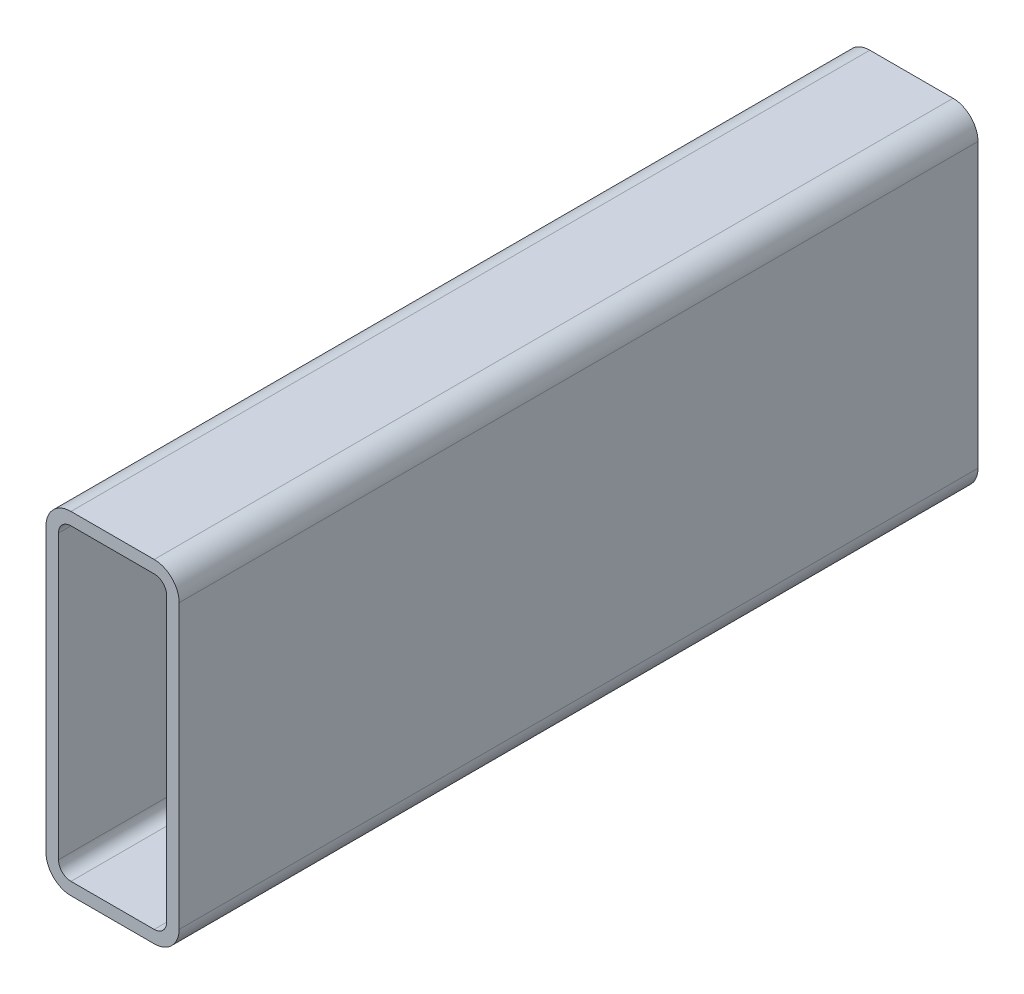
ISO-10303-21;
HEADER;
FILE_DESCRIPTION(('STEP AP214'),'2;1');
FILE_NAME('part.step','',(''),(''),'','','');
FILE_SCHEMA(('AUTOMOTIVE_DESIGN { 1 0 10303 214 1 1 1 1 }'));
ENDSEC;
DATA;
#1=APPLICATION_CONTEXT('core data for automotive mechanical design processes');
#2=APPLICATION_PROTOCOL_DEFINITION('international standard','automotive_design',2000,#1);
#3=PRODUCT_CONTEXT('',#1,'mechanical');
#4=PRODUCT('Part','Part','',(#3));
#5=PRODUCT_RELATED_PRODUCT_CATEGORY('part','',(#4));
#6=PRODUCT_DEFINITION_FORMATION('','',#4);
#7=PRODUCT_DEFINITION_CONTEXT('part definition',#1,'design');
#8=PRODUCT_DEFINITION('design','',#6,#7);
#9=PRODUCT_DEFINITION_SHAPE('','',#8);
#10=(LENGTH_UNIT() NAMED_UNIT(*) SI_UNIT(.MILLI.,.METRE.));
#11=(NAMED_UNIT(*) PLANE_ANGLE_UNIT() SI_UNIT($,.RADIAN.));
#12=(NAMED_UNIT(*) SI_UNIT($,.STERADIAN.) SOLID_ANGLE_UNIT());
#13=UNCERTAINTY_MEASURE_WITH_UNIT(LENGTH_MEASURE(1.E-05),#10,'distance_accuracy_value','');
#14=(GEOMETRIC_REPRESENTATION_CONTEXT(3) GLOBAL_UNCERTAINTY_ASSIGNED_CONTEXT((#13)) GLOBAL_UNIT_ASSIGNED_CONTEXT((#10,
#11,#12)) REPRESENTATION_CONTEXT('',''));
#15=CARTESIAN_POINT('',(0.,0.,0.));
#16=DIRECTION('',(0.,0.,1.));
#17=DIRECTION('',(1.,0.,0.));
#18=AXIS2_PLACEMENT_3D('',#15,#16,#17);
#19=CARTESIAN_POINT('',(9.52500000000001,117.475,304.8));
#20=DIRECTION('',(0.,0.,1.));
#21=DIRECTION('',(1.,0.,0.));
#22=AXIS2_PLACEMENT_3D('',#19,#20,#21);
#23=PLANE('',#22);
#24=CARTESIAN_POINT('',(9.52500000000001,117.475,304.8));
#25=DIRECTION('',(0.,0.,1.));
#26=DIRECTION('',(1.,0.,0.));
#27=AXIS2_PLACEMENT_3D('',#24,#25,#26);
#28=CIRCLE('',#27,9.52500000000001);
#29=CARTESIAN_POINT('',(9.525,127.,304.8));
#30=VERTEX_POINT('',#29);
#31=CARTESIAN_POINT('',(0.,117.475,304.8));
#32=VERTEX_POINT('',#31);
#33=EDGE_CURVE('E211',#30,#32,#28,.T.);
#34=ORIENTED_EDGE('',*,*,#33,.T.);
#35=DIRECTION('',(0.,-1.,0.));
#36=VECTOR('',#35,1.);
#37=CARTESIAN_POINT('',(0.,9.525,304.8));
#38=LINE('',#37,#36);
#39=CARTESIAN_POINT('',(0.,9.525,304.8));
#40=VERTEX_POINT('',#39);
#41=EDGE_CURVE('E214',#32,#40,#38,.T.);
#42=ORIENTED_EDGE('',*,*,#41,.T.);
#43=CARTESIAN_POINT('',(9.525,9.525,304.8));
#44=DIRECTION('',(0.,0.,1.));
#45=DIRECTION('',(1.,0.,0.));
#46=AXIS2_PLACEMENT_3D('',#43,#44,#45);
#47=CIRCLE('',#46,9.525);
#48=CARTESIAN_POINT('',(9.525,0.,304.8));
#49=VERTEX_POINT('',#48);
#50=EDGE_CURVE('E217',#40,#49,#47,.T.);
#51=ORIENTED_EDGE('',*,*,#50,.T.);
#52=DIRECTION('',(1.,0.,0.));
#53=VECTOR('',#52,1.);
#54=CARTESIAN_POINT('',(41.275,0.,304.8));
#55=LINE('',#54,#53);
#56=CARTESIAN_POINT('',(41.275,0.,304.8));
#57=VERTEX_POINT('',#56);
#58=EDGE_CURVE('E219',#49,#57,#55,.T.);
#59=ORIENTED_EDGE('',*,*,#58,.T.);
#60=CARTESIAN_POINT('',(41.275,9.525,304.8));
#61=DIRECTION('',(0.,0.,1.));
#62=DIRECTION('',(1.,0.,0.));
#63=AXIS2_PLACEMENT_3D('',#60,#61,#62);
#64=CIRCLE('',#63,9.525);
#65=CARTESIAN_POINT('',(50.8,9.525,304.8));
#66=VERTEX_POINT('',#65);
#67=EDGE_CURVE('E221',#57,#66,#64,.T.);
#68=ORIENTED_EDGE('',*,*,#67,.T.);
#69=DIRECTION('',(0.,1.,0.));
#70=VECTOR('',#69,1.);
#71=CARTESIAN_POINT('',(50.8,117.475,304.8));
#72=LINE('',#71,#70);
#73=CARTESIAN_POINT('',(50.8,117.475,304.8));
#74=VERTEX_POINT('',#73);
#75=EDGE_CURVE('E223',#66,#74,#72,.T.);
#76=ORIENTED_EDGE('',*,*,#75,.T.);
#77=CARTESIAN_POINT('',(41.275,117.475,304.8));
#78=DIRECTION('',(0.,0.,1.));
#79=DIRECTION('',(1.,0.,0.));
#80=AXIS2_PLACEMENT_3D('',#77,#78,#79);
#81=CIRCLE('',#80,9.52500000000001);
#82=CARTESIAN_POINT('',(41.275,127.,304.8));
#83=VERTEX_POINT('',#82);
#84=EDGE_CURVE('E225',#74,#83,#81,.T.);
#85=ORIENTED_EDGE('',*,*,#84,.T.);
#86=DIRECTION('',(-1.,0.,0.));
#87=VECTOR('',#86,1.);
#88=CARTESIAN_POINT('',(9.525,127.,304.8));
#89=LINE('',#88,#87);
#90=EDGE_CURVE('E227',#83,#30,#89,.T.);
#91=ORIENTED_EDGE('',*,*,#90,.T.);
#92=EDGE_LOOP('',(#34,#42,#51,#59,#68,#76,#85,#91));
#93=FACE_BOUND('',#92,.T.);
#94=DIRECTION('',(0.,-1.,0.));
#95=VECTOR('',#94,1.);
#96=CARTESIAN_POINT('',(4.7625,9.525,304.8));
#97=LINE('',#96,#95);
#98=CARTESIAN_POINT('',(4.7625,117.475,304.8));
#99=VERTEX_POINT('',#98);
#100=CARTESIAN_POINT('',(4.7625,9.525,304.8));
#101=VERTEX_POINT('',#100);
#102=EDGE_CURVE('E154',#99,#101,#97,.T.);
#103=ORIENTED_EDGE('',*,*,#102,.F.);
#104=CARTESIAN_POINT('',(9.52500000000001,117.475,304.8));
#105=DIRECTION('',(0.,0.,1.));
#106=DIRECTION('',(1.,0.,0.));
#107=AXIS2_PLACEMENT_3D('',#104,#105,#106);
#108=CIRCLE('',#107,4.7625);
#109=CARTESIAN_POINT('',(9.525,122.2375,304.8));
#110=VERTEX_POINT('',#109);
#111=EDGE_CURVE('E146',#110,#99,#108,.T.);
#112=ORIENTED_EDGE('',*,*,#111,.F.);
#113=DIRECTION('',(-1.,0.,0.));
#114=VECTOR('',#113,1.);
#115=CARTESIAN_POINT('',(9.525,122.2375,304.8));
#116=LINE('',#115,#114);
#117=CARTESIAN_POINT('',(41.275,122.2375,304.8));
#118=VERTEX_POINT('',#117);
#119=EDGE_CURVE('E179',#118,#110,#116,.T.);
#120=ORIENTED_EDGE('',*,*,#119,.F.);
#121=CARTESIAN_POINT('',(41.275,117.475,304.8));
#122=DIRECTION('',(0.,0.,1.));
#123=DIRECTION('',(1.,0.,0.));
#124=AXIS2_PLACEMENT_3D('',#121,#122,#123);
#125=CIRCLE('',#124,4.7625);
#126=CARTESIAN_POINT('',(46.0375,117.475,304.8));
#127=VERTEX_POINT('',#126);
#128=EDGE_CURVE('E177',#127,#118,#125,.T.);
#129=ORIENTED_EDGE('',*,*,#128,.F.);
#130=DIRECTION('',(0.,1.,0.));
#131=VECTOR('',#130,1.);
#132=CARTESIAN_POINT('',(46.0375,117.475,304.8));
#133=LINE('',#132,#131);
#134=CARTESIAN_POINT('',(46.0375,9.525,304.8));
#135=VERTEX_POINT('',#134);
#136=EDGE_CURVE('E175',#135,#127,#133,.T.);
#137=ORIENTED_EDGE('',*,*,#136,.F.);
#138=CARTESIAN_POINT('',(41.275,9.525,304.8));
#139=DIRECTION('',(0.,0.,1.));
#140=DIRECTION('',(1.,0.,0.));
#141=AXIS2_PLACEMENT_3D('',#138,#139,#140);
#142=CIRCLE('',#141,4.7625);
#143=CARTESIAN_POINT('',(41.275,4.7625,304.8));
#144=VERTEX_POINT('',#143);
#145=EDGE_CURVE('E173',#144,#135,#142,.T.);
#146=ORIENTED_EDGE('',*,*,#145,.F.);
#147=DIRECTION('',(1.,0.,0.));
#148=VECTOR('',#147,1.);
#149=CARTESIAN_POINT('',(41.275,4.7625,304.8));
#150=LINE('',#149,#148);
#151=CARTESIAN_POINT('',(9.525,4.7625,304.8));
#152=VERTEX_POINT('',#151);
#153=EDGE_CURVE('E169',#152,#144,#150,.T.);
#154=ORIENTED_EDGE('',*,*,#153,.F.);
#155=CARTESIAN_POINT('',(9.525,9.525,304.8));
#156=DIRECTION('',(0.,0.,1.));
#157=DIRECTION('',(1.,0.,0.));
#158=AXIS2_PLACEMENT_3D('',#155,#156,#157);
#159=CIRCLE('',#158,4.7625);
#160=EDGE_CURVE('E167',#101,#152,#159,.T.);
#161=ORIENTED_EDGE('',*,*,#160,.F.);
#162=EDGE_LOOP('',(#103,#112,#120,#129,#137,#146,#154,#161));
#163=FACE_BOUND('',#162,.T.);
#164=ADVANCED_FACE('F33',(#93,#163),#23,.T.);
#165=CARTESIAN_POINT('',(9.52500000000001,117.475,0.));
#166=DIRECTION('',(0.,0.,1.));
#167=DIRECTION('',(1.,0.,0.));
#168=AXIS2_PLACEMENT_3D('',#165,#166,#167);
#169=PLANE('',#168);
#170=CARTESIAN_POINT('',(9.52500000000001,117.475,0.));
#171=DIRECTION('',(0.,0.,1.));
#172=DIRECTION('',(1.,0.,0.));
#173=AXIS2_PLACEMENT_3D('',#170,#171,#172);
#174=CIRCLE('',#173,9.52500000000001);
#175=CARTESIAN_POINT('',(9.525,127.,0.));
#176=VERTEX_POINT('',#175);
#177=CARTESIAN_POINT('',(0.,117.475,0.));
#178=VERTEX_POINT('',#177);
#179=EDGE_CURVE('E162',#176,#178,#174,.T.);
#180=ORIENTED_EDGE('',*,*,#179,.F.);
#181=DIRECTION('',(-1.,0.,0.));
#182=VECTOR('',#181,1.);
#183=CARTESIAN_POINT('',(9.525,127.,0.));
#184=LINE('',#183,#182);
#185=CARTESIAN_POINT('',(41.275,127.,0.));
#186=VERTEX_POINT('',#185);
#187=EDGE_CURVE('E215',#186,#176,#184,.T.);
#188=ORIENTED_EDGE('',*,*,#187,.F.);
#189=CARTESIAN_POINT('',(41.275,117.475,0.));
#190=DIRECTION('',(0.,0.,1.));
#191=DIRECTION('',(1.,0.,0.));
#192=AXIS2_PLACEMENT_3D('',#189,#190,#191);
#193=CIRCLE('',#192,9.52500000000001);
#194=CARTESIAN_POINT('',(50.8,117.475,0.));
#195=VERTEX_POINT('',#194);
#196=EDGE_CURVE('E242',#195,#186,#193,.T.);
#197=ORIENTED_EDGE('',*,*,#196,.F.);
#198=DIRECTION('',(0.,1.,0.));
#199=VECTOR('',#198,1.);
#200=CARTESIAN_POINT('',(50.8,117.475,0.));
#201=LINE('',#200,#199);
#202=CARTESIAN_POINT('',(50.8,9.525,0.));
#203=VERTEX_POINT('',#202);
#204=EDGE_CURVE('E240',#203,#195,#201,.T.);
#205=ORIENTED_EDGE('',*,*,#204,.F.);
#206=CARTESIAN_POINT('',(41.275,9.525,0.));
#207=DIRECTION('',(0.,0.,1.));
#208=DIRECTION('',(1.,0.,0.));
#209=AXIS2_PLACEMENT_3D('',#206,#207,#208);
#210=CIRCLE('',#209,9.525);
#211=CARTESIAN_POINT('',(41.275,0.,0.));
#212=VERTEX_POINT('',#211);
#213=EDGE_CURVE('E238',#212,#203,#210,.T.);
#214=ORIENTED_EDGE('',*,*,#213,.F.);
#215=DIRECTION('',(1.,0.,0.));
#216=VECTOR('',#215,1.);
#217=CARTESIAN_POINT('',(41.275,0.,0.));
#218=LINE('',#217,#216);
#219=CARTESIAN_POINT('',(9.525,0.,0.));
#220=VERTEX_POINT('',#219);
#221=EDGE_CURVE('E236',#220,#212,#218,.T.);
#222=ORIENTED_EDGE('',*,*,#221,.F.);
#223=CARTESIAN_POINT('',(9.525,9.525,0.));
#224=DIRECTION('',(0.,0.,1.));
#225=DIRECTION('',(1.,0.,0.));
#226=AXIS2_PLACEMENT_3D('',#223,#224,#225);
#227=CIRCLE('',#226,9.525);
#228=CARTESIAN_POINT('',(0.,9.525,0.));
#229=VERTEX_POINT('',#228);
#230=EDGE_CURVE('E234',#229,#220,#227,.T.);
#231=ORIENTED_EDGE('',*,*,#230,.F.);
#232=DIRECTION('',(0.,-1.,0.));
#233=VECTOR('',#232,1.);
#234=CARTESIAN_POINT('',(0.,9.525,0.));
#235=LINE('',#234,#233);
#236=EDGE_CURVE('E232',#178,#229,#235,.T.);
#237=ORIENTED_EDGE('',*,*,#236,.F.);
#238=EDGE_LOOP('',(#180,#188,#197,#205,#214,#222,#231,#237));
#239=FACE_BOUND('',#238,.T.);
#240=CARTESIAN_POINT('',(9.52500000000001,117.475,0.));
#241=DIRECTION('',(0.,0.,1.));
#242=DIRECTION('',(1.,0.,0.));
#243=AXIS2_PLACEMENT_3D('',#240,#241,#242);
#244=CIRCLE('',#243,4.7625);
#245=CARTESIAN_POINT('',(9.525,122.2375,0.));
#246=VERTEX_POINT('',#245);
#247=CARTESIAN_POINT('',(4.7625,117.475,0.));
#248=VERTEX_POINT('',#247);
#249=EDGE_CURVE('E56',#246,#248,#244,.T.);
#250=ORIENTED_EDGE('',*,*,#249,.T.);
#251=DIRECTION('',(0.,-1.,0.));
#252=VECTOR('',#251,1.);
#253=CARTESIAN_POINT('',(4.7625,9.525,0.));
#254=LINE('',#253,#252);
#255=CARTESIAN_POINT('',(4.7625,9.525,0.));
#256=VERTEX_POINT('',#255);
#257=EDGE_CURVE('E161',#248,#256,#254,.T.);
#258=ORIENTED_EDGE('',*,*,#257,.T.);
#259=CARTESIAN_POINT('',(9.525,9.525,0.));
#260=DIRECTION('',(0.,0.,1.));
#261=DIRECTION('',(1.,0.,0.));
#262=AXIS2_PLACEMENT_3D('',#259,#260,#261);
#263=CIRCLE('',#262,4.7625);
#264=CARTESIAN_POINT('',(9.525,4.7625,0.));
#265=VERTEX_POINT('',#264);
#266=EDGE_CURVE('E183',#256,#265,#263,.T.);
#267=ORIENTED_EDGE('',*,*,#266,.T.);
#268=DIRECTION('',(1.,0.,0.));
#269=VECTOR('',#268,1.);
#270=CARTESIAN_POINT('',(41.275,4.7625,0.));
#271=LINE('',#270,#269);
#272=CARTESIAN_POINT('',(41.275,4.7625,0.));
#273=VERTEX_POINT('',#272);
#274=EDGE_CURVE('E186',#265,#273,#271,.T.);
#275=ORIENTED_EDGE('',*,*,#274,.T.);
#276=CARTESIAN_POINT('',(41.275,9.525,0.));
#277=DIRECTION('',(0.,0.,1.));
#278=DIRECTION('',(1.,0.,0.));
#279=AXIS2_PLACEMENT_3D('',#276,#277,#278);
#280=CIRCLE('',#279,4.7625);
#281=CARTESIAN_POINT('',(46.0375,9.525,0.));
#282=VERTEX_POINT('',#281);
#283=EDGE_CURVE('E189',#273,#282,#280,.T.);
#284=ORIENTED_EDGE('',*,*,#283,.T.);
#285=DIRECTION('',(0.,1.,0.));
#286=VECTOR('',#285,1.);
#287=CARTESIAN_POINT('',(46.0375,117.475,0.));
#288=LINE('',#287,#286);
#289=CARTESIAN_POINT('',(46.0375,117.475,0.));
#290=VERTEX_POINT('',#289);
#291=EDGE_CURVE('E192',#282,#290,#288,.T.);
#292=ORIENTED_EDGE('',*,*,#291,.T.);
#293=CARTESIAN_POINT('',(41.275,117.475,0.));
#294=DIRECTION('',(0.,0.,1.));
#295=DIRECTION('',(1.,0.,0.));
#296=AXIS2_PLACEMENT_3D('',#293,#294,#295);
#297=CIRCLE('',#296,4.7625);
#298=CARTESIAN_POINT('',(41.275,122.2375,0.));
#299=VERTEX_POINT('',#298);
#300=EDGE_CURVE('E195',#290,#299,#297,.T.);
#301=ORIENTED_EDGE('',*,*,#300,.T.);
#302=DIRECTION('',(-1.,0.,0.));
#303=VECTOR('',#302,1.);
#304=CARTESIAN_POINT('',(9.525,122.2375,0.));
#305=LINE('',#304,#303);
#306=EDGE_CURVE('E155',#299,#246,#305,.T.);
#307=ORIENTED_EDGE('',*,*,#306,.T.);
#308=EDGE_LOOP('',(#250,#258,#267,#275,#284,#292,#301,#307));
#309=FACE_BOUND('',#308,.T.);
#310=ADVANCED_FACE('F272',(#239,#309),#169,.F.);
#311=CARTESIAN_POINT('',(9.52500000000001,117.475,304.8));
#312=DIRECTION('',(0.,0.,-1.));
#313=DIRECTION('',(-1.,0.,0.));
#314=AXIS2_PLACEMENT_3D('',#311,#312,#313);
#315=CYLINDRICAL_SURFACE('',#314,9.52500000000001);
#316=ORIENTED_EDGE('',*,*,#179,.T.);
#317=DIRECTION('',(0.,0.,-1.));
#318=VECTOR('',#317,1.);
#319=CARTESIAN_POINT('',(0.,117.475,304.8));
#320=LINE('',#319,#318);
#321=EDGE_CURVE('E11',#32,#178,#320,.T.);
#322=ORIENTED_EDGE('',*,*,#321,.F.);
#323=ORIENTED_EDGE('',*,*,#33,.F.);
#324=DIRECTION('',(0.,0.,-1.));
#325=VECTOR('',#324,1.);
#326=CARTESIAN_POINT('',(9.525,127.,304.8));
#327=LINE('',#326,#325);
#328=EDGE_CURVE('E229',#30,#176,#327,.T.);
#329=ORIENTED_EDGE('',*,*,#328,.T.);
#330=EDGE_LOOP('',(#316,#322,#323,#329));
#331=FACE_BOUND('',#330,.T.);
#332=ADVANCED_FACE('F35',(#331),#315,.T.);
#333=CARTESIAN_POINT('',(0.,9.525,304.8));
#334=DIRECTION('',(1.,0.,0.));
#335=DIRECTION('',(0.,0.,-1.));
#336=AXIS2_PLACEMENT_3D('',#333,#334,#335);
#337=PLANE('',#336);
#338=ORIENTED_EDGE('',*,*,#236,.T.);
#339=DIRECTION('',(0.,0.,-1.));
#340=VECTOR('',#339,1.);
#341=CARTESIAN_POINT('',(0.,9.525,304.8));
#342=LINE('',#341,#340);
#343=EDGE_CURVE('E41',#40,#229,#342,.T.);
#344=ORIENTED_EDGE('',*,*,#343,.F.);
#345=ORIENTED_EDGE('',*,*,#41,.F.);
#346=ORIENTED_EDGE('',*,*,#321,.T.);
#347=EDGE_LOOP('',(#338,#344,#345,#346));
#348=FACE_BOUND('',#347,.T.);
#349=ADVANCED_FACE('F289',(#348),#337,.F.);
#350=CARTESIAN_POINT('',(9.525,9.525,304.8));
#351=DIRECTION('',(0.,0.,-1.));
#352=DIRECTION('',(-1.,0.,0.));
#353=AXIS2_PLACEMENT_3D('',#350,#351,#352);
#354=CYLINDRICAL_SURFACE('',#353,9.525);
#355=ORIENTED_EDGE('',*,*,#230,.T.);
#356=DIRECTION('',(0.,0.,-1.));
#357=VECTOR('',#356,1.);
#358=CARTESIAN_POINT('',(9.525,0.,304.8));
#359=LINE('',#358,#357);
#360=EDGE_CURVE('E259',#49,#220,#359,.T.);
#361=ORIENTED_EDGE('',*,*,#360,.F.);
#362=ORIENTED_EDGE('',*,*,#50,.F.);
#363=ORIENTED_EDGE('',*,*,#343,.T.);
#364=EDGE_LOOP('',(#355,#361,#362,#363));
#365=FACE_BOUND('',#364,.T.);
#366=ADVANCED_FACE('F266',(#365),#354,.T.);
#367=CARTESIAN_POINT('',(41.275,0.,304.8));
#368=DIRECTION('',(0.,1.,0.));
#369=DIRECTION('',(0.,0.,1.));
#370=AXIS2_PLACEMENT_3D('',#367,#368,#369);
#371=PLANE('',#370);
#372=ORIENTED_EDGE('',*,*,#221,.T.);
#373=DIRECTION('',(0.,0.,-1.));
#374=VECTOR('',#373,1.);
#375=CARTESIAN_POINT('',(41.275,0.,304.8));
#376=LINE('',#375,#374);
#377=EDGE_CURVE('E256',#57,#212,#376,.T.);
#378=ORIENTED_EDGE('',*,*,#377,.F.);
#379=ORIENTED_EDGE('',*,*,#58,.F.);
#380=ORIENTED_EDGE('',*,*,#360,.T.);
#381=EDGE_LOOP('',(#372,#378,#379,#380));
#382=FACE_BOUND('',#381,.T.);
#383=ADVANCED_FACE('F278',(#382),#371,.F.);
#384=CARTESIAN_POINT('',(41.275,9.525,304.8));
#385=DIRECTION('',(0.,0.,-1.));
#386=DIRECTION('',(-1.,0.,0.));
#387=AXIS2_PLACEMENT_3D('',#384,#385,#386);
#388=CYLINDRICAL_SURFACE('',#387,9.525);
#389=ORIENTED_EDGE('',*,*,#213,.T.);
#390=DIRECTION('',(0.,0.,-1.));
#391=VECTOR('',#390,1.);
#392=CARTESIAN_POINT('',(50.8,9.525,304.8));
#393=LINE('',#392,#391);
#394=EDGE_CURVE('E253',#66,#203,#393,.T.);
#395=ORIENTED_EDGE('',*,*,#394,.F.);
#396=ORIENTED_EDGE('',*,*,#67,.F.);
#397=ORIENTED_EDGE('',*,*,#377,.T.);
#398=EDGE_LOOP('',(#389,#395,#396,#397));
#399=FACE_BOUND('',#398,.T.);
#400=ADVANCED_FACE('F282',(#399),#388,.T.);
#401=CARTESIAN_POINT('',(50.8,117.475,304.8));
#402=DIRECTION('',(-1.,0.,0.));
#403=DIRECTION('',(0.,0.,1.));
#404=AXIS2_PLACEMENT_3D('',#401,#402,#403);
#405=PLANE('',#404);
#406=ORIENTED_EDGE('',*,*,#204,.T.);
#407=DIRECTION('',(0.,0.,-1.));
#408=VECTOR('',#407,1.);
#409=CARTESIAN_POINT('',(50.8,117.475,304.8));
#410=LINE('',#409,#408);
#411=EDGE_CURVE('E250',#74,#195,#410,.T.);
#412=ORIENTED_EDGE('',*,*,#411,.F.);
#413=ORIENTED_EDGE('',*,*,#75,.F.);
#414=ORIENTED_EDGE('',*,*,#394,.T.);
#415=EDGE_LOOP('',(#406,#412,#413,#414));
#416=FACE_BOUND('',#415,.T.);
#417=ADVANCED_FACE('F302',(#416),#405,.F.);
#418=CARTESIAN_POINT('',(41.275,117.475,304.8));
#419=DIRECTION('',(0.,0.,-1.));
#420=DIRECTION('',(-1.,0.,0.));
#421=AXIS2_PLACEMENT_3D('',#418,#419,#420);
#422=CYLINDRICAL_SURFACE('',#421,9.52500000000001);
#423=ORIENTED_EDGE('',*,*,#196,.T.);
#424=DIRECTION('',(0.,0.,-1.));
#425=VECTOR('',#424,1.);
#426=CARTESIAN_POINT('',(41.275,127.,304.8));
#427=LINE('',#426,#425);
#428=EDGE_CURVE('E247',#83,#186,#427,.T.);
#429=ORIENTED_EDGE('',*,*,#428,.F.);
#430=ORIENTED_EDGE('',*,*,#84,.F.);
#431=ORIENTED_EDGE('',*,*,#411,.T.);
#432=EDGE_LOOP('',(#423,#429,#430,#431));
#433=FACE_BOUND('',#432,.T.);
#434=ADVANCED_FACE('F300',(#433),#422,.T.);
#435=CARTESIAN_POINT('',(9.525,127.,304.8));
#436=DIRECTION('',(0.,-1.,0.));
#437=DIRECTION('',(0.,0.,-1.));
#438=AXIS2_PLACEMENT_3D('',#435,#436,#437);
#439=PLANE('',#438);
#440=ORIENTED_EDGE('',*,*,#187,.T.);
#441=ORIENTED_EDGE('',*,*,#328,.F.);
#442=ORIENTED_EDGE('',*,*,#90,.F.);
#443=ORIENTED_EDGE('',*,*,#428,.T.);
#444=EDGE_LOOP('',(#440,#441,#442,#443));
#445=FACE_BOUND('',#444,.T.);
#446=ADVANCED_FACE('F295',(#445),#439,.F.);
#447=CARTESIAN_POINT('',(9.52500000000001,117.475,304.8));
#448=DIRECTION('',(0.,0.,-1.));
#449=DIRECTION('',(-1.,0.,0.));
#450=AXIS2_PLACEMENT_3D('',#447,#448,#449);
#451=CYLINDRICAL_SURFACE('',#450,4.7625);
#452=ORIENTED_EDGE('',*,*,#249,.F.);
#453=DIRECTION('',(0.,0.,-1.));
#454=VECTOR('',#453,1.);
#455=CARTESIAN_POINT('',(9.525,122.2375,304.8));
#456=LINE('',#455,#454);
#457=EDGE_CURVE('E150',#110,#246,#456,.T.);
#458=ORIENTED_EDGE('',*,*,#457,.F.);
#459=ORIENTED_EDGE('',*,*,#111,.T.);
#460=DIRECTION('',(0.,0.,-1.));
#461=VECTOR('',#460,1.);
#462=CARTESIAN_POINT('',(4.7625,117.475,304.8));
#463=LINE('',#462,#461);
#464=EDGE_CURVE('E149',#99,#248,#463,.T.);
#465=ORIENTED_EDGE('',*,*,#464,.T.);
#466=EDGE_LOOP('',(#452,#458,#459,#465));
#467=FACE_BOUND('',#466,.T.);
#468=ADVANCED_FACE('F148',(#467),#451,.F.);
#469=CARTESIAN_POINT('',(4.7625,9.525,304.8));
#470=DIRECTION('',(1.,0.,0.));
#471=DIRECTION('',(0.,0.,-1.));
#472=AXIS2_PLACEMENT_3D('',#469,#470,#471);
#473=PLANE('',#472);
#474=ORIENTED_EDGE('',*,*,#257,.F.);
#475=ORIENTED_EDGE('',*,*,#464,.F.);
#476=ORIENTED_EDGE('',*,*,#102,.T.);
#477=DIRECTION('',(0.,0.,-1.));
#478=VECTOR('',#477,1.);
#479=CARTESIAN_POINT('',(4.7625,9.525,304.8));
#480=LINE('',#479,#478);
#481=EDGE_CURVE('E163',#101,#256,#480,.T.);
#482=ORIENTED_EDGE('',*,*,#481,.T.);
#483=EDGE_LOOP('',(#474,#475,#476,#482));
#484=FACE_BOUND('',#483,.T.);
#485=ADVANCED_FACE('F158',(#484),#473,.T.);
#486=CARTESIAN_POINT('',(9.525,9.525,304.8));
#487=DIRECTION('',(0.,0.,-1.));
#488=DIRECTION('',(-1.,0.,0.));
#489=AXIS2_PLACEMENT_3D('',#486,#487,#488);
#490=CYLINDRICAL_SURFACE('',#489,4.7625);
#491=ORIENTED_EDGE('',*,*,#266,.F.);
#492=ORIENTED_EDGE('',*,*,#481,.F.);
#493=ORIENTED_EDGE('',*,*,#160,.T.);
#494=DIRECTION('',(0.,0.,-1.));
#495=VECTOR('',#494,1.);
#496=CARTESIAN_POINT('',(9.525,4.7625,304.8));
#497=LINE('',#496,#495);
#498=EDGE_CURVE('E208',#152,#265,#497,.T.);
#499=ORIENTED_EDGE('',*,*,#498,.T.);
#500=EDGE_LOOP('',(#491,#492,#493,#499));
#501=FACE_BOUND('',#500,.T.);
#502=ADVANCED_FACE('F327',(#501),#490,.F.);
#503=CARTESIAN_POINT('',(41.275,4.7625,304.8));
#504=DIRECTION('',(0.,1.,0.));
#505=DIRECTION('',(0.,0.,1.));
#506=AXIS2_PLACEMENT_3D('',#503,#504,#505);
#507=PLANE('',#506);
#508=ORIENTED_EDGE('',*,*,#274,.F.);
#509=ORIENTED_EDGE('',*,*,#498,.F.);
#510=ORIENTED_EDGE('',*,*,#153,.T.);
#511=DIRECTION('',(0.,0.,-1.));
#512=VECTOR('',#511,1.);
#513=CARTESIAN_POINT('',(41.275,4.7625,304.8));
#514=LINE('',#513,#512);
#515=EDGE_CURVE('E206',#144,#273,#514,.T.);
#516=ORIENTED_EDGE('',*,*,#515,.T.);
#517=EDGE_LOOP('',(#508,#509,#510,#516));
#518=FACE_BOUND('',#517,.T.);
#519=ADVANCED_FACE('F331',(#518),#507,.T.);
#520=CARTESIAN_POINT('',(41.275,9.525,304.8));
#521=DIRECTION('',(0.,0.,-1.));
#522=DIRECTION('',(-1.,0.,0.));
#523=AXIS2_PLACEMENT_3D('',#520,#521,#522);
#524=CYLINDRICAL_SURFACE('',#523,4.7625);
#525=ORIENTED_EDGE('',*,*,#283,.F.);
#526=ORIENTED_EDGE('',*,*,#515,.F.);
#527=ORIENTED_EDGE('',*,*,#145,.T.);
#528=DIRECTION('',(0.,0.,-1.));
#529=VECTOR('',#528,1.);
#530=CARTESIAN_POINT('',(46.0375,9.525,304.8));
#531=LINE('',#530,#529);
#532=EDGE_CURVE('E204',#135,#282,#531,.T.);
#533=ORIENTED_EDGE('',*,*,#532,.T.);
#534=EDGE_LOOP('',(#525,#526,#527,#533));
#535=FACE_BOUND('',#534,.T.);
#536=ADVANCED_FACE('F337',(#535),#524,.F.);
#537=CARTESIAN_POINT('',(46.0375,117.475,304.8));
#538=DIRECTION('',(-1.,0.,0.));
#539=DIRECTION('',(0.,0.,1.));
#540=AXIS2_PLACEMENT_3D('',#537,#538,#539);
#541=PLANE('',#540);
#542=ORIENTED_EDGE('',*,*,#291,.F.);
#543=ORIENTED_EDGE('',*,*,#532,.F.);
#544=ORIENTED_EDGE('',*,*,#136,.T.);
#545=DIRECTION('',(0.,0.,-1.));
#546=VECTOR('',#545,1.);
#547=CARTESIAN_POINT('',(46.0375,117.475,304.8));
#548=LINE('',#547,#546);
#549=EDGE_CURVE('E202',#127,#290,#548,.T.);
#550=ORIENTED_EDGE('',*,*,#549,.T.);
#551=EDGE_LOOP('',(#542,#543,#544,#550));
#552=FACE_BOUND('',#551,.T.);
#553=ADVANCED_FACE('F341',(#552),#541,.T.);
#554=CARTESIAN_POINT('',(41.275,117.475,304.8));
#555=DIRECTION('',(0.,0.,-1.));
#556=DIRECTION('',(-1.,0.,0.));
#557=AXIS2_PLACEMENT_3D('',#554,#555,#556);
#558=CYLINDRICAL_SURFACE('',#557,4.7625);
#559=ORIENTED_EDGE('',*,*,#300,.F.);
#560=ORIENTED_EDGE('',*,*,#549,.F.);
#561=ORIENTED_EDGE('',*,*,#128,.T.);
#562=DIRECTION('',(0.,0.,-1.));
#563=VECTOR('',#562,1.);
#564=CARTESIAN_POINT('',(41.275,122.2375,304.8));
#565=LINE('',#564,#563);
#566=EDGE_CURVE('E48',#118,#299,#565,.T.);
#567=ORIENTED_EDGE('',*,*,#566,.T.);
#568=EDGE_LOOP('',(#559,#560,#561,#567));
#569=FACE_BOUND('',#568,.T.);
#570=ADVANCED_FACE('F345',(#569),#558,.F.);
#571=CARTESIAN_POINT('',(9.525,122.2375,304.8));
#572=DIRECTION('',(0.,-1.,0.));
#573=DIRECTION('',(0.,0.,-1.));
#574=AXIS2_PLACEMENT_3D('',#571,#572,#573);
#575=PLANE('',#574);
#576=ORIENTED_EDGE('',*,*,#306,.F.);
#577=ORIENTED_EDGE('',*,*,#566,.F.);
#578=ORIENTED_EDGE('',*,*,#119,.T.);
#579=ORIENTED_EDGE('',*,*,#457,.T.);
#580=EDGE_LOOP('',(#576,#577,#578,#579));
#581=FACE_BOUND('',#580,.T.);
#582=ADVANCED_FACE('F349',(#581),#575,.T.);
#583=CLOSED_SHELL('',(#164,#310,#332,#349,#366,#383,#400,#417,#434,#446,#468,#485,#502,#519,
#536,#553,#570,#582));
#584=MANIFOLD_SOLID_BREP('B2',#583);
#585=ADVANCED_BREP_SHAPE_REPRESENTATION('',(#18,#584),#14);
#586=SHAPE_DEFINITION_REPRESENTATION(#9,#585);
ENDSEC;
END-ISO-10303-21;
